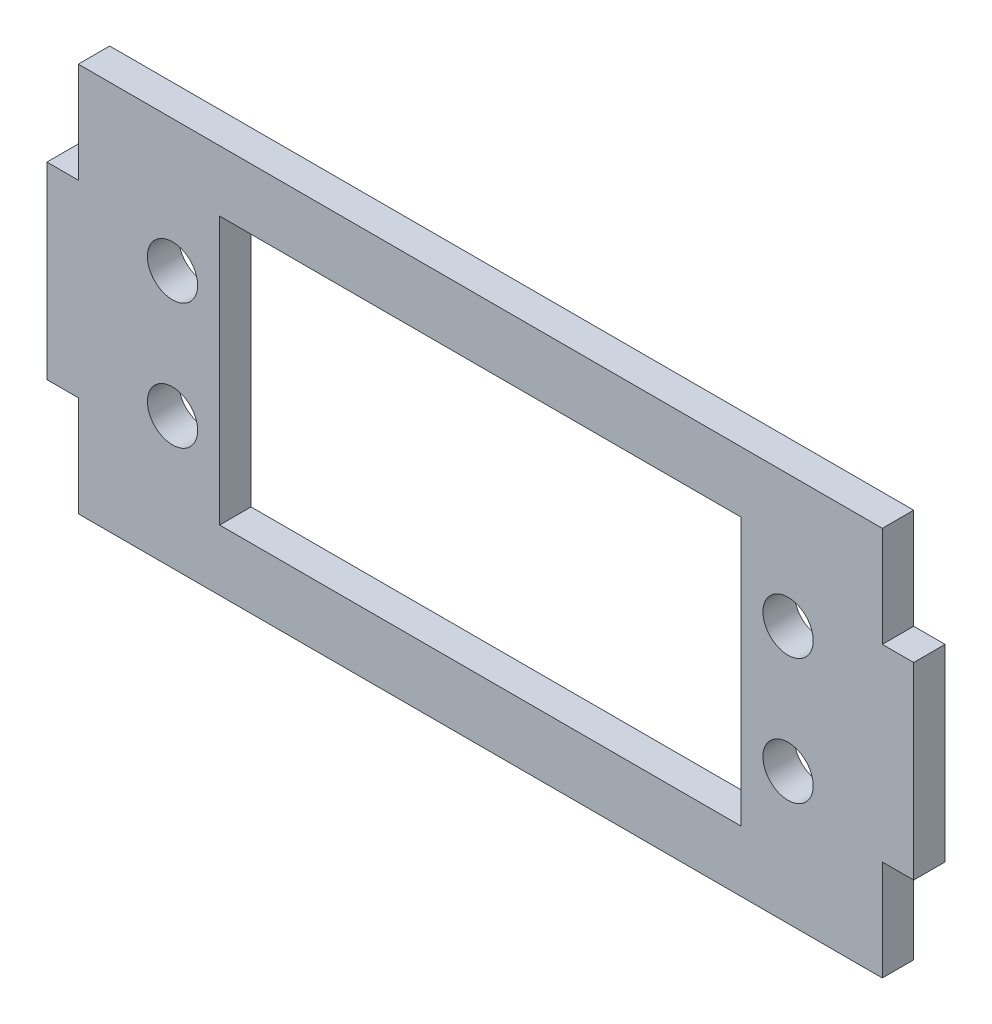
from build123d import *

# Parameters (mm, degrees)
SKETCH1_W           = 41.498202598
SKETCH1_H           = 21.298202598
BOSS_EXTRUDE1_DEPTH = 2.5
SKETCH2_R           = 2
CUT_EXTRUDE1_DEPTH  = 10


with BuildPart() as part:
    # Sketch1 → Boss-Extrude1 (new body)
    with BuildSketch(Plane.XY):
        Polygon((-22, 15.5), (42, 15.5), (42, 7.5), (44.5, 7.5), (44.5, -7.5), (42, -7.5), (42, -15.5), (-22, -15.5), (-22, -7.5), (-24.5, -7.5), (-24.5, 7.5), (-22, 7.5), align=None)
        with Locations((10, 0)):
            Rectangle(SKETCH1_W, SKETCH1_H, mode=Mode.SUBTRACT)
    extrude(amount=BOSS_EXTRUDE1_DEPTH)

    # Sketch2 → Cut-Extrude1 (cut)
    with BuildSketch(Plane(origin=(0, 0, 0), x_dir=(-1, 0, 0), z_dir=(0, 0, -1))):
        with Locations((14.5, 5)):
            Circle(SKETCH2_R)
        with Locations((14.5, -5)):
            Circle(SKETCH2_R)
        with Locations((-34.5, -5)):
            Circle(SKETCH2_R)
        with Locations((-34.5, 5)):
            Circle(SKETCH2_R)
    extrude(amount=-CUT_EXTRUDE1_DEPTH, mode=Mode.SUBTRACT)


solid = part.part
